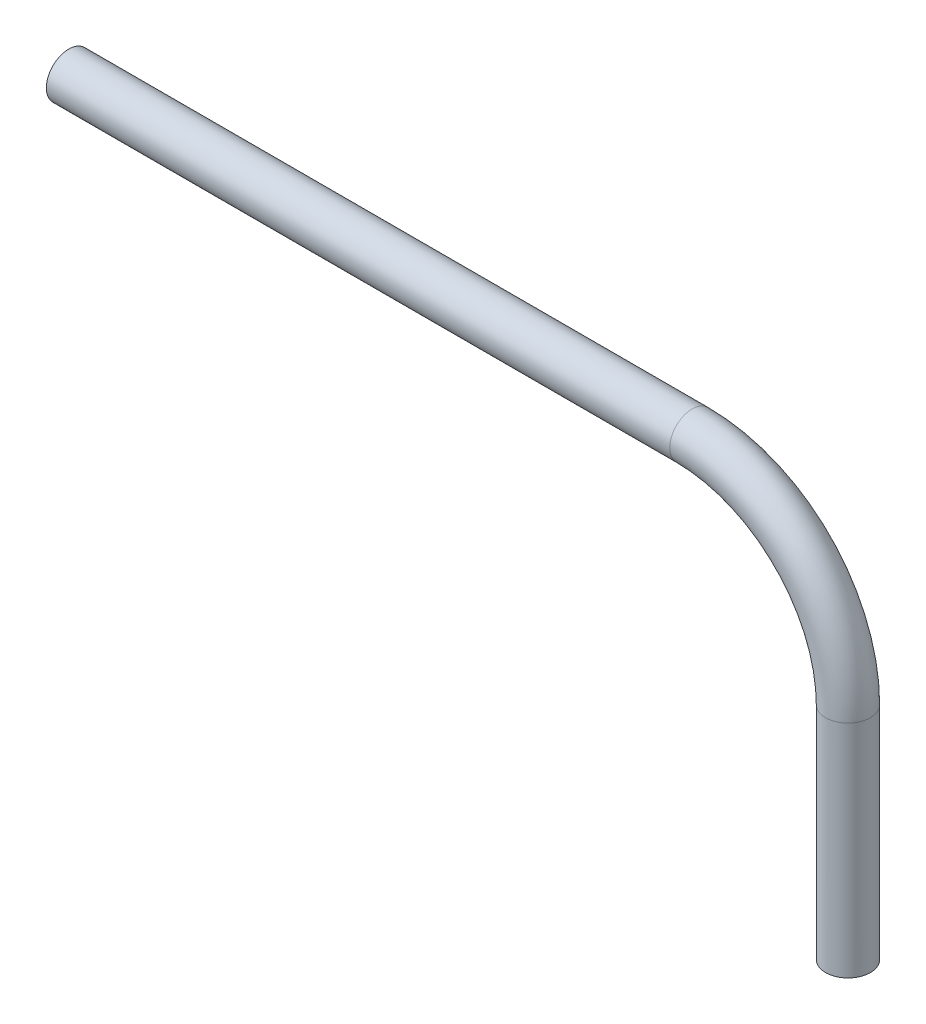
ISO-10303-21;
HEADER;
FILE_DESCRIPTION(('STEP AP214'),'2;1');
FILE_NAME('part.step','',(''),(''),'','','');
FILE_SCHEMA(('AUTOMOTIVE_DESIGN { 1 0 10303 214 1 1 1 1 }'));
ENDSEC;
DATA;
#1=APPLICATION_CONTEXT('core data for automotive mechanical design processes');
#2=APPLICATION_PROTOCOL_DEFINITION('international standard','automotive_design',2000,#1);
#3=PRODUCT_CONTEXT('',#1,'mechanical');
#4=PRODUCT('Part','Part','',(#3));
#5=PRODUCT_RELATED_PRODUCT_CATEGORY('part','',(#4));
#6=PRODUCT_DEFINITION_FORMATION('','',#4);
#7=PRODUCT_DEFINITION_CONTEXT('part definition',#1,'design');
#8=PRODUCT_DEFINITION('design','',#6,#7);
#9=PRODUCT_DEFINITION_SHAPE('','',#8);
#10=(LENGTH_UNIT() NAMED_UNIT(*) SI_UNIT(.MILLI.,.METRE.));
#11=(NAMED_UNIT(*) PLANE_ANGLE_UNIT() SI_UNIT($,.RADIAN.));
#12=(NAMED_UNIT(*) SI_UNIT($,.STERADIAN.) SOLID_ANGLE_UNIT());
#13=UNCERTAINTY_MEASURE_WITH_UNIT(LENGTH_MEASURE(1.E-05),#10,'distance_accuracy_value','');
#14=(GEOMETRIC_REPRESENTATION_CONTEXT(3) GLOBAL_UNCERTAINTY_ASSIGNED_CONTEXT((#13)) GLOBAL_UNIT_ASSIGNED_CONTEXT((#10,
#11,#12)) REPRESENTATION_CONTEXT('',''));
#15=CARTESIAN_POINT('',(0.,0.,0.));
#16=DIRECTION('',(0.,0.,1.));
#17=DIRECTION('',(1.,0.,0.));
#18=AXIS2_PLACEMENT_3D('',#15,#16,#17);
#19=CARTESIAN_POINT('',(0.,0.,0.));
#20=DIRECTION('',(0.,1.,0.));
#21=DIRECTION('',(-1.,0.,0.));
#22=AXIS2_PLACEMENT_3D('',#19,#20,#21);
#23=CYLINDRICAL_SURFACE('',#22,14.5);
#24=CARTESIAN_POINT('',(0.,0.,0.));
#25=DIRECTION('',(0.,1.,0.));
#26=DIRECTION('',(-1.,0.,0.));
#27=AXIS2_PLACEMENT_3D('',#24,#25,#26);
#28=CIRCLE('',#27,14.5);
#29=CARTESIAN_POINT('',(-14.5,0.,0.));
#30=VERTEX_POINT('',#29);
#31=EDGE_CURVE('E18',#30,#30,#28,.F.);
#32=ORIENTED_EDGE('',*,*,#31,.T.);
#33=EDGE_LOOP('',(#32));
#34=FACE_BOUND('',#33,.T.);
#35=CARTESIAN_POINT('',(0.,170.,0.));
#36=DIRECTION('',(0.,1.,0.));
#37=DIRECTION('',(1.,0.,0.));
#38=AXIS2_PLACEMENT_3D('',#35,#36,#37);
#39=CIRCLE('',#38,14.5);
#40=CARTESIAN_POINT('',(14.5,170.,0.));
#41=VERTEX_POINT('',#40);
#42=EDGE_CURVE('E66',#41,#41,#39,.T.);
#43=ORIENTED_EDGE('',*,*,#42,.T.);
#44=EDGE_LOOP('',(#43));
#45=FACE_BOUND('',#44,.T.);
#46=ADVANCED_FACE('F15',(#34,#45),#23,.F.);
#47=CARTESIAN_POINT('',(-120.,170.,0.));
#48=DIRECTION('',(0.,0.,1.));
#49=DIRECTION('',(1.,0.,0.));
#50=AXIS2_PLACEMENT_3D('',#47,#48,#49);
#51=TOROIDAL_SURFACE('',#50,120.,14.5);
#52=ORIENTED_EDGE('',*,*,#42,.F.);
#53=EDGE_LOOP('',(#52));
#54=FACE_BOUND('',#53,.T.);
#55=CARTESIAN_POINT('',(-120.,290.,0.));
#56=DIRECTION('',(-1.,0.,0.));
#57=DIRECTION('',(0.,-1.,0.));
#58=AXIS2_PLACEMENT_3D('',#55,#56,#57);
#59=CIRCLE('',#58,14.5);
#60=CARTESIAN_POINT('',(-120.,275.5,0.));
#61=VERTEX_POINT('',#60);
#62=EDGE_CURVE('E75',#61,#61,#59,.T.);
#63=ORIENTED_EDGE('',*,*,#62,.T.);
#64=EDGE_LOOP('',(#63));
#65=FACE_BOUND('',#64,.T.);
#66=ADVANCED_FACE('F56',(#54,#65),#51,.F.);
#67=CARTESIAN_POINT('',(0.,0.,0.));
#68=DIRECTION('',(0.,1.,0.));
#69=DIRECTION('',(0.,0.,1.));
#70=AXIS2_PLACEMENT_3D('',#67,#68,#69);
#71=PLANE('',#70);
#72=CARTESIAN_POINT('',(0.,0.,0.));
#73=DIRECTION('',(0.,1.,0.));
#74=DIRECTION('',(-1.,0.,0.));
#75=AXIS2_PLACEMENT_3D('',#72,#73,#74);
#76=CIRCLE('',#75,17.25);
#77=CARTESIAN_POINT('',(-17.25,0.,0.));
#78=VERTEX_POINT('',#77);
#79=EDGE_CURVE('E73',#78,#78,#76,.T.);
#80=ORIENTED_EDGE('',*,*,#79,.F.);
#81=EDGE_LOOP('',(#80));
#82=FACE_BOUND('',#81,.T.);
#83=ORIENTED_EDGE('',*,*,#31,.F.);
#84=EDGE_LOOP('',(#83));
#85=FACE_BOUND('',#84,.T.);
#86=ADVANCED_FACE('F53',(#82,#85),#71,.F.);
#87=CARTESIAN_POINT('',(-120.,290.,0.));
#88=DIRECTION('',(-1.,0.,0.));
#89=DIRECTION('',(0.,-1.,0.));
#90=AXIS2_PLACEMENT_3D('',#87,#88,#89);
#91=CYLINDRICAL_SURFACE('',#90,14.5);
#92=ORIENTED_EDGE('',*,*,#62,.F.);
#93=EDGE_LOOP('',(#92));
#94=FACE_BOUND('',#93,.T.);
#95=CARTESIAN_POINT('',(-600.,290.,0.));
#96=DIRECTION('',(-1.,0.,0.));
#97=DIRECTION('',(0.,-1.,0.));
#98=AXIS2_PLACEMENT_3D('',#95,#96,#97);
#99=CIRCLE('',#98,14.5);
#100=CARTESIAN_POINT('',(-600.,275.5,0.));
#101=VERTEX_POINT('',#100);
#102=EDGE_CURVE('E71',#101,#101,#99,.F.);
#103=ORIENTED_EDGE('',*,*,#102,.F.);
#104=EDGE_LOOP('',(#103));
#105=FACE_BOUND('',#104,.T.);
#106=ADVANCED_FACE('F49',(#94,#105),#91,.F.);
#107=CARTESIAN_POINT('',(0.,0.,0.));
#108=DIRECTION('',(0.,1.,0.));
#109=DIRECTION('',(-1.,0.,0.));
#110=AXIS2_PLACEMENT_3D('',#107,#108,#109);
#111=CYLINDRICAL_SURFACE('',#110,17.25);
#112=ORIENTED_EDGE('',*,*,#79,.T.);
#113=EDGE_LOOP('',(#112));
#114=FACE_BOUND('',#113,.T.);
#115=CARTESIAN_POINT('',(0.,170.,0.));
#116=DIRECTION('',(0.,1.,0.));
#117=DIRECTION('',(1.,0.,0.));
#118=AXIS2_PLACEMENT_3D('',#115,#116,#117);
#119=CIRCLE('',#118,17.25);
#120=CARTESIAN_POINT('',(17.25,170.,0.));
#121=VERTEX_POINT('',#120);
#122=EDGE_CURVE('E27',#121,#121,#119,.T.);
#123=ORIENTED_EDGE('',*,*,#122,.F.);
#124=EDGE_LOOP('',(#123));
#125=FACE_BOUND('',#124,.T.);
#126=ADVANCED_FACE('F45',(#114,#125),#111,.T.);
#127=CARTESIAN_POINT('',(-600.,290.,0.));
#128=DIRECTION('',(-1.,0.,0.));
#129=DIRECTION('',(0.,-1.,0.));
#130=AXIS2_PLACEMENT_3D('',#127,#128,#129);
#131=PLANE('',#130);
#132=CARTESIAN_POINT('',(-600.,290.,0.));
#133=DIRECTION('',(-1.,0.,0.));
#134=DIRECTION('',(0.,-1.,0.));
#135=AXIS2_PLACEMENT_3D('',#132,#133,#134);
#136=CIRCLE('',#135,17.25);
#137=CARTESIAN_POINT('',(-600.,272.75,0.));
#138=VERTEX_POINT('',#137);
#139=EDGE_CURVE('E22',#138,#138,#136,.F.);
#140=ORIENTED_EDGE('',*,*,#139,.F.);
#141=EDGE_LOOP('',(#140));
#142=FACE_BOUND('',#141,.T.);
#143=ORIENTED_EDGE('',*,*,#102,.T.);
#144=EDGE_LOOP('',(#143));
#145=FACE_BOUND('',#144,.T.);
#146=ADVANCED_FACE('F41',(#142,#145),#131,.T.);
#147=CARTESIAN_POINT('',(-120.,170.,0.));
#148=DIRECTION('',(0.,0.,1.));
#149=DIRECTION('',(1.,0.,0.));
#150=AXIS2_PLACEMENT_3D('',#147,#148,#149);
#151=TOROIDAL_SURFACE('',#150,120.,17.25);
#152=ORIENTED_EDGE('',*,*,#122,.T.);
#153=EDGE_LOOP('',(#152));
#154=FACE_BOUND('',#153,.T.);
#155=CARTESIAN_POINT('',(-120.,290.,0.));
#156=DIRECTION('',(-1.,0.,0.));
#157=DIRECTION('',(0.,-1.,0.));
#158=AXIS2_PLACEMENT_3D('',#155,#156,#157);
#159=CIRCLE('',#158,17.25);
#160=CARTESIAN_POINT('',(-120.,272.75,0.));
#161=VERTEX_POINT('',#160);
#162=EDGE_CURVE('E10',#161,#161,#159,.T.);
#163=ORIENTED_EDGE('',*,*,#162,.F.);
#164=EDGE_LOOP('',(#163));
#165=FACE_BOUND('',#164,.T.);
#166=ADVANCED_FACE('F36',(#154,#165),#151,.T.);
#167=CARTESIAN_POINT('',(-120.,290.,0.));
#168=DIRECTION('',(-1.,0.,0.));
#169=DIRECTION('',(0.,-1.,0.));
#170=AXIS2_PLACEMENT_3D('',#167,#168,#169);
#171=CYLINDRICAL_SURFACE('',#170,17.25);
#172=ORIENTED_EDGE('',*,*,#162,.T.);
#173=EDGE_LOOP('',(#172));
#174=FACE_BOUND('',#173,.T.);
#175=ORIENTED_EDGE('',*,*,#139,.T.);
#176=EDGE_LOOP('',(#175));
#177=FACE_BOUND('',#176,.T.);
#178=ADVANCED_FACE('F40',(#174,#177),#171,.T.);
#179=CLOSED_SHELL('',(#46,#66,#86,#106,#126,#146,#166,#178));
#180=MANIFOLD_SOLID_BREP('B1',#179);
#181=ADVANCED_BREP_SHAPE_REPRESENTATION('',(#18,#180),#14);
#182=SHAPE_DEFINITION_REPRESENTATION(#9,#181);
ENDSEC;
END-ISO-10303-21;
